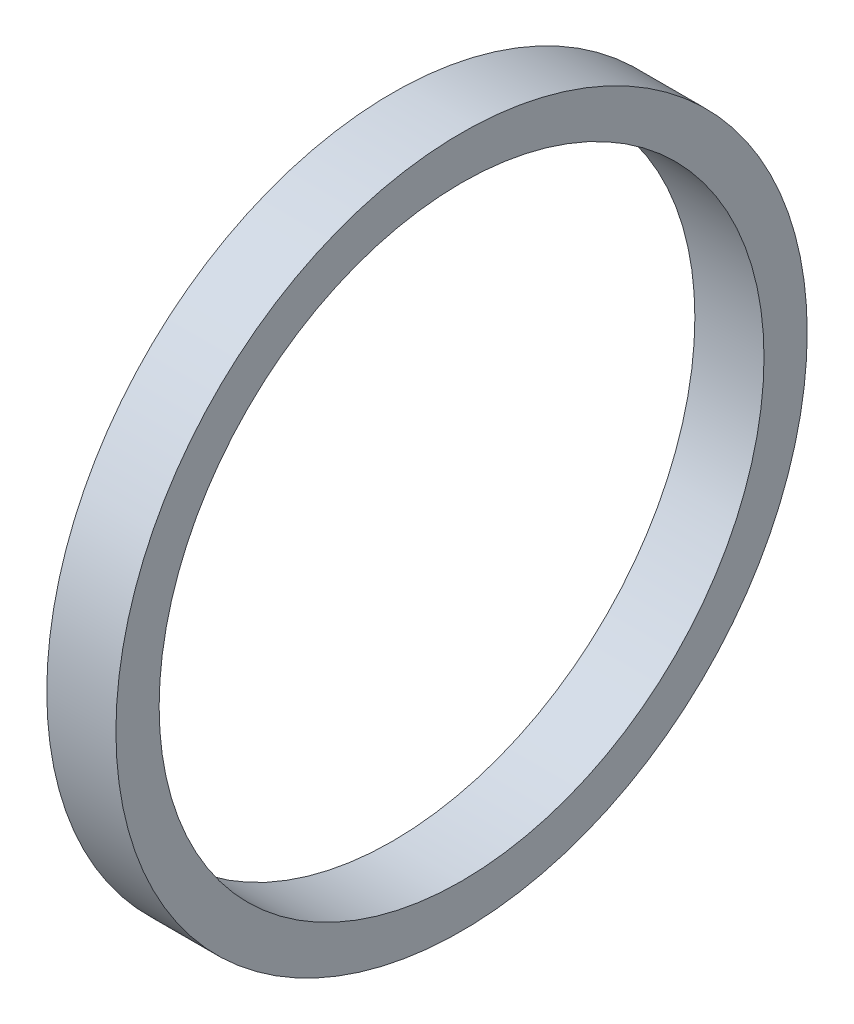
from build123d import *

# Parameters (mm, degrees)
SKETCH1_W = 16
SKETCH1_H = 10


with BuildPart() as part:
    # Sketch1 → Revolve1 (revolve)
    with BuildSketch(Plane.XY, mode=Mode.PRIVATE) as revolve1_sk:
        with Locations((-8, 75)):
            Rectangle(SKETCH1_W, SKETCH1_H)
    revolve(revolve1_sk.sketch.rotate(Axis((0, 0, 0), (-1, 0, 0)), 90), axis=Axis((0, 0, 0), (-1, 0, 0)))


solid = part.part
